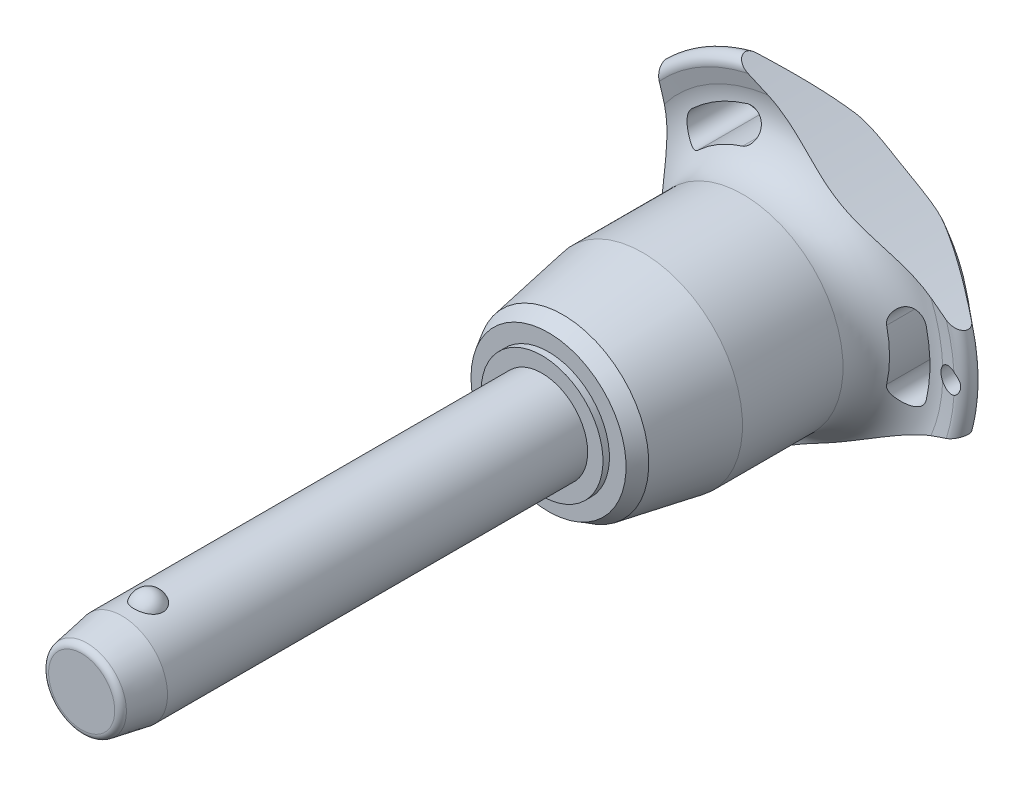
from build123d import *

# Parameters (mm, degrees)
SKETCH1_R           = 6
BOSS_EXTRUDE1_DEPTH = 50
SKETCH2_R           = 5.15
BOSS_EXTRUDE2_DEPTH = 39.7
BOSS_EXTRUDE3_START = 10.6
SKETCH1_2_R         = 6
BOSS_EXTRUDE3_DEPTH = 10.6
CHAMFER1_SIZE       = 5.3
CHAMFER1_SIZE2      = 0.934532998
FILLET1_R           = 0.85
SKETCH6_R           = 144.275
CUT_EXTRUDE1_DEPTH  = 96.809732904
CIRPATTERN1_COUNT   = 3
SKETCH7_R           = 1.5
CUT_EXTRUDE2_DEPTH  = 96.600036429


with BuildPart() as part:
    # Sketch1 → Boss-Extrude1 (new body)
    with BuildSketch(Plane.XY):
        Circle(SKETCH1_R)
    extrude(amount=-BOSS_EXTRUDE1_DEPTH)

    # Sketch2 → Boss-Extrude2 (add)
    with BuildSketch(Plane(origin=(0, 0, -50), x_dir=(-1, 0, 0), z_dir=(0, 0, -1))):
        Circle(SKETCH2_R)
    extrude(amount=BOSS_EXTRUDE2_DEPTH)

    # Sketch3 → Revolve1 (revolve)
    with BuildSketch(Plane(origin=(0, 0, 0), x_dir=(0, 0, -1), z_dir=(1, 0, 0))):
        with BuildLine():
            Line((-1.854049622, 7.25), (-1.854049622, 3.25))
            ThreePointArc((-1.854049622, 3.25), (0.145950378, 5.25), (-1.854049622, 7.25))
        make_face()
        with BuildLine():
            Line((-1.854049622, -3.25), (-1.854049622, -7.25))
            ThreePointArc((-1.854049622, -7.25), (0.145950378, -5.25), (-1.854049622, -3.25))
        make_face()
    revolve(axis=Axis((0, -3.25, 1.854049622), (0, 1, 0)))

    # Sketch1_2 → Boss-Extrude3 (add)
    with BuildSketch(Plane.XY.offset(BOSS_EXTRUDE3_START)):
        Circle(SKETCH1_2_R)
    extrude(amount=-BOSS_EXTRUDE3_DEPTH)

    # Chamfer1
    chamfer1_edges = [part.edges().sort_by_distance(p)[0] for p in [
        (-6, 0, 10.6),
    ]]
    chamfer1_side = [part.faces().sort_by_distance(p)[0] for p in [
        (-6, 0, -19.7),
    ]]
    chamfer(chamfer1_edges, length=CHAMFER1_SIZE, length2=CHAMFER1_SIZE2, reference=chamfer1_side[0])

    # Fillet1
    fillet1_edges = [part.edges().sort_by_distance(p)[0] for p in [
        (-5.065467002, 0, 10.6),
        (5.15, 0, -89.7),
    ]]
    fillet(fillet1_edges, radius=FILLET1_R)

    # Sketch4 → Revolve2 (revolve)
    with BuildSketch(Plane(origin=(0, 0, 0), x_dir=(0, 0, -1), z_dir=(1, 0, 0)), mode=Mode.PRIVATE) as revolve2_sk:
        Polygon((50, 0), (50, 8.017240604), (50.85, 8.017240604), (50.85, 10.206249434), (52.745737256, 11.300753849), (63.233333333, 13.15), (76.466666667, 13.15), (76.466666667, 0), align=None)
    revolve(revolve2_sk.sketch.rotate(Axis((0, 0, -76.466666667), (0, 0, 1)), 90), axis=Axis((0, 0, -76.466666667), (0, 0, 1)))

    # Sketch5 → Revolve3 (revolve)
    with BuildSketch(Plane(origin=(0, 0, 0), x_dir=(0, 0, -1), z_dir=(1, 0, 0)), mode=Mode.PRIVATE) as revolve3_sk:
        with BuildLine():
            Line((82.32877039, 20.428960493), (81.910912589, 22.344207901))
            ThreePointArc((81.910912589, 22.344207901), (82.554394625, 23.677136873), (84.002586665, 23.371345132))
            Line((84.002586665, 23.371345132), (89.141488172, 17.247040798))
            ThreePointArc((89.141488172, 17.247040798), (89.7, 15.584758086), (88.978803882, 13.986322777))
            ThreePointArc((88.978803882, 13.986322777), (84.617427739, 7.589034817), (83.083333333, 0))
            Line((83.083333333, 0), (76.466666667, 0))
            Line((76.466666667, 0), (76.466666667, 13.15))
            ThreePointArc((76.466666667, 13.15), (81.139661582, 15.38660811), (82.32877039, 20.428960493))
        make_face()
    revolve(revolve3_sk.sketch.rotate(Axis((0, 0, -83.083333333), (0, 0, 1)), 90), axis=Axis((0, 0, -83.083333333), (0, 0, 1)))

    # Sketch6 → Cut-Extrude1 (cut, through all)
    with BuildSketch(Plane.XY):
        with Locations((-159.975, 0)):
            Circle(SKETCH6_R)
        with BuildLine():
            ThreePointArc((18.131206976, -4.190753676), (18.60922037, 0), (18.131206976, 4.190753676))
            ThreePointArc((18.131206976, 4.190753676), (15.94840906, 5.553949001), (14.585213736, 3.371151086))
            ThreePointArc((14.585213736, 3.371151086), (14.969740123, 0), (14.585213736, -3.371151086))
            ThreePointArc((14.585213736, -3.371151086), (15.94840906, -5.553949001), (18.131206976, -4.190753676))
        make_face()
    cut_extrude1 = extrude(amount=-CUT_EXTRUDE1_DEPTH, mode=Mode.SUBTRACT)

    # CirPattern1: Cut-Extrude1 ×3 about axis
    cirpattern1_axis = Axis((0, 0, 0), (0, 0, 1))
    for i in range(1, CIRPATTERN1_COUNT):
        add(cut_extrude1.rotate(cirpattern1_axis, i * 360 / CIRPATTERN1_COUNT), mode=Mode.SUBTRACT)

    # Sketch7 → Cut-Extrude2 (cut, through all)
    with BuildSketch(Plane.XY):
        with Locations(Location((21.60922037, 0, 0), (0, 0, 297.620773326))):
            Circle(SKETCH7_R)
    extrude(amount=-CUT_EXTRUDE2_DEPTH, mode=Mode.SUBTRACT)


solid = part.part
